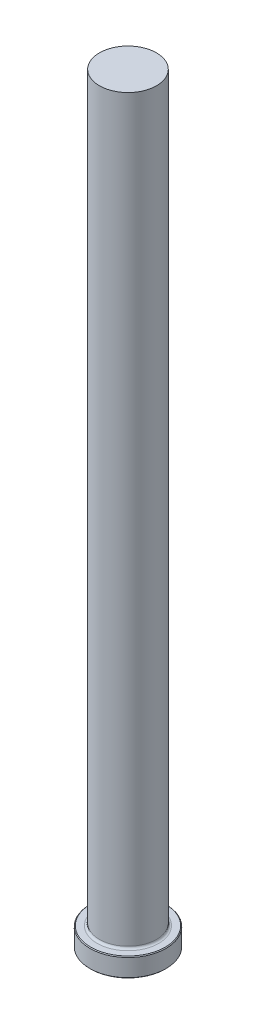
from build123d import *

# Parameters (mm, degrees)
CHAMFER1_SIZE = 0.254
FILLET1_R     = 0.762


with BuildPart() as part:
    # Sketch1 → Revolve1 (revolve)
    with BuildSketch(Plane.XY, mode=Mode.PRIVATE) as revolve1_sk:
        Polygon((0, 0), (-12.7, 0), (-12.7, 6.35), (-9.525, 6.35), (-9.525, 254), (0, 254), align=None)
    revolve(revolve1_sk.sketch.rotate(Axis((0, 259.958771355, 0), (0, -1, 0)), 270), axis=Axis((0, 259.958771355, 0), (0, -1, 0)))

    # Chamfer1
    chamfer1_edges = [part.edges().sort_by_distance(p)[0] for p in [
        (0, 6.35, -12.7),
        (0, 0, -12.7),
    ]]
    chamfer(chamfer1_edges, length=CHAMFER1_SIZE)

    # Fillet1
    fillet1_edges = [part.edges().sort_by_distance(p)[0] for p in [
        (0, 6.35, -9.525),
    ]]
    fillet(fillet1_edges, radius=FILLET1_R)


solid = part.part
